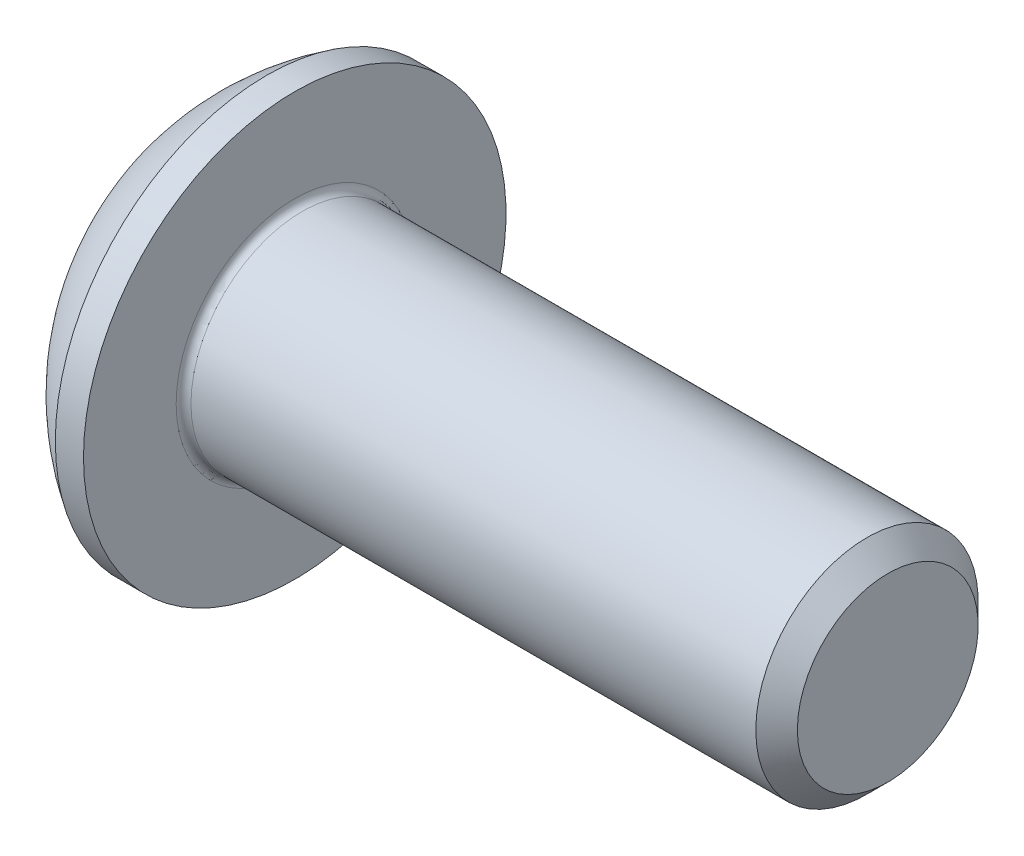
ISO-10303-21;
HEADER;
FILE_DESCRIPTION(('STEP AP214'),'2;1');
FILE_NAME('part.step','',(''),(''),'','','');
FILE_SCHEMA(('AUTOMOTIVE_DESIGN { 1 0 10303 214 1 1 1 1 }'));
ENDSEC;
DATA;
#1=APPLICATION_CONTEXT('core data for automotive mechanical design processes');
#2=APPLICATION_PROTOCOL_DEFINITION('international standard','automotive_design',2000,#1);
#3=PRODUCT_CONTEXT('',#1,'mechanical');
#4=PRODUCT('Part','Part','',(#3));
#5=PRODUCT_RELATED_PRODUCT_CATEGORY('part','',(#4));
#6=PRODUCT_DEFINITION_FORMATION('','',#4);
#7=PRODUCT_DEFINITION_CONTEXT('part definition',#1,'design');
#8=PRODUCT_DEFINITION('design','',#6,#7);
#9=PRODUCT_DEFINITION_SHAPE('','',#8);
#10=(LENGTH_UNIT() NAMED_UNIT(*) SI_UNIT(.MILLI.,.METRE.));
#11=(NAMED_UNIT(*) PLANE_ANGLE_UNIT() SI_UNIT($,.RADIAN.));
#12=(NAMED_UNIT(*) SI_UNIT($,.STERADIAN.) SOLID_ANGLE_UNIT());
#13=UNCERTAINTY_MEASURE_WITH_UNIT(LENGTH_MEASURE(1.E-05),#10,'distance_accuracy_value','');
#14=(GEOMETRIC_REPRESENTATION_CONTEXT(3) GLOBAL_UNCERTAINTY_ASSIGNED_CONTEXT((#13)) GLOBAL_UNIT_ASSIGNED_CONTEXT((#10,
#11,#12)) REPRESENTATION_CONTEXT('',''));
#15=CARTESIAN_POINT('',(0.,0.,0.));
#16=DIRECTION('',(0.,0.,1.));
#17=DIRECTION('',(1.,0.,0.));
#18=AXIS2_PLACEMENT_3D('',#15,#16,#17);
#19=CARTESIAN_POINT('',(0.,0.,0.));
#20=DIRECTION('',(-1.,0.,0.));
#21=DIRECTION('',(0.,0.,1.));
#22=AXIS2_PLACEMENT_3D('',#19,#20,#21);
#23=PLANE('',#22);
#24=CARTESIAN_POINT('',(0.,0.,0.));
#25=DIRECTION('',(-1.,0.,0.));
#26=DIRECTION('',(0.,0.,1.));
#27=AXIS2_PLACEMENT_3D('',#24,#25,#26);
#28=CIRCLE('',#27,1.425);
#29=CARTESIAN_POINT('',(0.,1.425,0.));
#30=VERTEX_POINT('',#29);
#31=EDGE_CURVE('E159',#30,#30,#28,.T.);
#32=ORIENTED_EDGE('',*,*,#31,.T.);
#33=EDGE_LOOP('',(#32));
#34=FACE_BOUND('',#33,.T.);
#35=DIRECTION('',(0.,-1.,0.));
#36=VECTOR('',#35,1.);
#37=CARTESIAN_POINT('',(0.,-0.577350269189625,0.999999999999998));
#38=LINE('',#37,#36);
#39=CARTESIAN_POINT('',(0.,0.577350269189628,1.));
#40=VERTEX_POINT('',#39);
#41=CARTESIAN_POINT('',(0.,-0.577350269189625,0.999999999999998));
#42=VERTEX_POINT('',#41);
#43=EDGE_CURVE('E54',#40,#42,#38,.T.);
#44=ORIENTED_EDGE('',*,*,#43,.T.);
#45=DIRECTION('',(0.,-0.499999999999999,-0.866025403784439));
#46=VECTOR('',#45,1.);
#47=CARTESIAN_POINT('',(0.,-1.15470053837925,0.));
#48=LINE('',#47,#46);
#49=CARTESIAN_POINT('',(0.,-1.15470053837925,0.));
#50=VERTEX_POINT('',#49);
#51=EDGE_CURVE('E279',#42,#50,#48,.T.);
#52=ORIENTED_EDGE('',*,*,#51,.T.);
#53=DIRECTION('',(0.,0.499999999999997,-0.86602540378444));
#54=VECTOR('',#53,1.);
#55=CARTESIAN_POINT('',(0.,-0.577350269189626,-1.));
#56=LINE('',#55,#54);
#57=CARTESIAN_POINT('',(0.,-0.577350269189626,-1.));
#58=VERTEX_POINT('',#57);
#59=EDGE_CURVE('E134',#50,#58,#56,.T.);
#60=ORIENTED_EDGE('',*,*,#59,.T.);
#61=DIRECTION('',(0.,1.,0.));
#62=VECTOR('',#61,1.);
#63=CARTESIAN_POINT('',(0.,0.577350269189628,-1.));
#64=LINE('',#63,#62);
#65=CARTESIAN_POINT('',(0.,0.577350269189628,-1.));
#66=VERTEX_POINT('',#65);
#67=EDGE_CURVE('E282',#58,#66,#64,.T.);
#68=ORIENTED_EDGE('',*,*,#67,.T.);
#69=DIRECTION('',(0.,0.499999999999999,0.866025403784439));
#70=VECTOR('',#69,1.);
#71=CARTESIAN_POINT('',(0.,1.15470053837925,0.));
#72=LINE('',#71,#70);
#73=CARTESIAN_POINT('',(0.,1.15470053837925,0.));
#74=VERTEX_POINT('',#73);
#75=EDGE_CURVE('E284',#66,#74,#72,.T.);
#76=ORIENTED_EDGE('',*,*,#75,.T.);
#77=DIRECTION('',(0.,-0.499999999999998,0.866025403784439));
#78=VECTOR('',#77,1.);
#79=CARTESIAN_POINT('',(0.,0.577350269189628,1.));
#80=LINE('',#79,#78);
#81=EDGE_CURVE('E286',#74,#40,#80,.T.);
#82=ORIENTED_EDGE('',*,*,#81,.T.);
#83=EDGE_LOOP('',(#44,#52,#60,#68,#76,#82));
#84=FACE_BOUND('',#83,.T.);
#85=ADVANCED_FACE('F39',(#34,#84),#23,.T.);
#86=CARTESIAN_POINT('',(3.03337598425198,0.,0.));
#87=DIRECTION('',(-1.,0.,0.));
#88=DIRECTION('',(0.,1.,0.));
#89=AXIS2_PLACEMENT_3D('',#86,#87,#88);
#90=SPHERICAL_SURFACE('',#89,3.35141684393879);
#91=CARTESIAN_POINT('',(1.27,0.,0.));
#92=DIRECTION('',(-1.,0.,0.));
#93=DIRECTION('',(0.,0.,1.));
#94=AXIS2_PLACEMENT_3D('',#91,#92,#93);
#95=CIRCLE('',#94,2.85);
#96=CARTESIAN_POINT('',(1.27,2.85,0.));
#97=VERTEX_POINT('',#96);
#98=EDGE_CURVE('E156',#97,#97,#95,.T.);
#99=CARTESIAN_POINT('',(1.27,2.85,0.));
#100=CARTESIAN_POINT('',(1.2528541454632,2.83939139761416,0.));
#101=CARTESIAN_POINT('',(1.23580404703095,2.82862803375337,0.));
#102=CARTESIAN_POINT('',(1.20190086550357,2.80679536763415,0.));
#103=CARTESIAN_POINT('',(1.18504778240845,2.79572606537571,0.));
#104=CARTESIAN_POINT('',(1.15154413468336,2.77328510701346,0.));
#105=CARTESIAN_POINT('',(1.13489357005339,2.76191345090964,0.));
#106=CARTESIAN_POINT('',(1.10180037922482,2.73887149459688,0.));
#107=CARTESIAN_POINT('',(1.08535775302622,2.72720119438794,0.));
#108=CARTESIAN_POINT('',(1.05268579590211,2.70356574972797,0.));
#109=CARTESIAN_POINT('',(1.03645646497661,2.69160060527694,0.));
#110=CARTESIAN_POINT('',(1.00421638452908,2.66737936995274,0.));
#111=CARTESIAN_POINT('',(0.988205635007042,2.65512327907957,0.));
#112=CARTESIAN_POINT('',(0.956407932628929,2.63032414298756,0.));
#113=CARTESIAN_POINT('',(0.940620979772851,2.61778109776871,0.));
#114=CARTESIAN_POINT('',(0.909276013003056,2.59241213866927,0.));
#115=CARTESIAN_POINT('',(0.89371799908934,2.57958622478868,0.));
#116=CARTESIAN_POINT('',(0.862835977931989,2.55365570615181,0.));
#117=CARTESIAN_POINT('',(0.847511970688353,2.54055110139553,0.));
#118=CARTESIAN_POINT('',(0.817102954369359,2.5140674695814,0.));
#119=CARTESIAN_POINT('',(0.802017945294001,2.50068844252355,0.));
#120=CARTESIAN_POINT('',(0.772091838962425,2.47366032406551,0.));
#121=CARTESIAN_POINT('',(0.757250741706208,2.46001123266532,0.));
#122=CARTESIAN_POINT('',(0.727817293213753,2.43244743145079,0.));
#123=CARTESIAN_POINT('',(0.713224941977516,2.41853272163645,0.));
#124=CARTESIAN_POINT('',(0.68429373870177,2.39044221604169,0.));
#125=CARTESIAN_POINT('',(0.669954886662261,2.37626642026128,0.));
#126=CARTESIAN_POINT('',(0.641535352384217,2.3476583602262,0.));
#127=CARTESIAN_POINT('',(0.627454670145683,2.33322609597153,0.));
#128=CARTESIAN_POINT('',(0.599556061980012,2.30410980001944,0.));
#129=CARTESIAN_POINT('',(0.585738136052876,2.289425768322,0.));
#130=CARTESIAN_POINT('',(0.55836954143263,2.25981072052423,0.));
#131=CARTESIAN_POINT('',(0.54481887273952,2.24487970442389,0.));
#132=CARTESIAN_POINT('',(0.517989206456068,2.21477555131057,0.));
#133=CARTESIAN_POINT('',(0.504710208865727,2.19960241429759,0.));
#134=CARTESIAN_POINT('',(0.478428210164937,2.16901896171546,0.));
#135=CARTESIAN_POINT('',(0.465425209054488,2.15360864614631,0.));
#136=CARTESIAN_POINT('',(0.439699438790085,2.12255585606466,0.));
#137=CARTESIAN_POINT('',(0.426976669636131,2.10691338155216,0.));
#138=CARTESIAN_POINT('',(0.401815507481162,2.07540136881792,0.));
#139=CARTESIAN_POINT('',(0.389377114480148,2.05953183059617,0.));
#140=CARTESIAN_POINT('',(0.364788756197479,2.02757085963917,0.));
#141=CARTESIAN_POINT('',(0.352638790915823,2.0114794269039,0.));
#142=CARTESIAN_POINT('',(0.328631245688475,1.97907990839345,0.));
#143=CARTESIAN_POINT('',(0.316773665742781,1.96277182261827,0.));
#144=CARTESIAN_POINT('',(0.293354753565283,1.92994431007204,0.));
#145=CARTESIAN_POINT('',(0.281793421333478,1.91342488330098,0.));
#146=CARTESIAN_POINT('',(0.258970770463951,1.88018006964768,0.));
#147=CARTESIAN_POINT('',(0.24770945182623,1.86345468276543,0.));
#148=CARTESIAN_POINT('',(0.225490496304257,1.82980339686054,0.));
#149=CARTESIAN_POINT('',(0.214532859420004,1.8128774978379,0.));
#150=CARTESIAN_POINT('',(0.192924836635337,1.77883070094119,0.));
#151=CARTESIAN_POINT('',(0.182274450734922,1.76170980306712,0.));
#152=CARTESIAN_POINT('',(0.161284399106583,1.72727858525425,0.));
#153=CARTESIAN_POINT('',(0.150944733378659,1.70996826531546,0.));
#154=CARTESIAN_POINT('',(0.13057948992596,1.6751638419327,0.));
#155=CARTESIAN_POINT('',(0.120553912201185,1.65766973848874,0.));
#156=CARTESIAN_POINT('',(0.100820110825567,1.62250344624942,0.));
#157=CARTESIAN_POINT('',(0.0911118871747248,1.60483125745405,0.));
#158=CARTESIAN_POINT('',(0.0720159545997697,1.56931455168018,0.));
#159=CARTESIAN_POINT('',(0.062628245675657,1.55147003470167,0.));
#160=CARTESIAN_POINT('',(0.0441764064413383,1.51561448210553,0.));
#161=CARTESIAN_POINT('',(0.0351122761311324,1.49760344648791,0.));
#162=CARTESIAN_POINT('',(0.017310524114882,1.46142073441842,0.));
#163=CARTESIAN_POINT('',(0.00857290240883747,1.44324905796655,0.));
#164=CARTESIAN_POINT('',(0.,1.425,0.));
#165=B_SPLINE_CURVE_WITH_KNOTS('',3,(#99,#100,#101,#102,#103,#104,#105,#106,#107,#108,#109,#110,
#111,#112,#113,#114,#115,#116,#117,#118,#119,#120,#121,#122,#123,#124,#125,#126,#127,#128,#129,
#130,#131,#132,#133,#134,#135,#136,#137,#138,#139,#140,#141,#142,#143,#144,#145,#146,#147,#148,
#149,#150,#151,#152,#153,#154,#155,#156,#157,#158,#159,#160,#161,#162,#163,#164),.UNSPECIFIED.,
.F.,.F.,(4,2,2,2,2,2,2,2,2,2,2,2,2,2,2,2,2,2,2,2,2,2,2,2,2,2,2,2,2,2,2,2,4),(0.,
0.0604864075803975,0.120972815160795,0.181459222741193,0.24194563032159,0.302432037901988,
0.362918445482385,0.423404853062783,0.483891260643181,0.544377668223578,0.604864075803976,
0.665350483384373,0.725836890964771,0.786323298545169,0.846809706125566,0.907296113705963,
0.967782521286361,1.02826892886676,1.08875533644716,1.14924174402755,1.20972815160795,
1.27021455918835,1.33070096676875,1.39118737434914,1.45167378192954,1.51216018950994,
1.57264659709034,1.63313300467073,1.69361941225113,1.75410581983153,1.81459222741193,
1.87507863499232,1.93556504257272),.UNSPECIFIED.);
#166=EDGE_CURVE('BSEAM180',#97,#30,#165,.T.);
#167=ORIENTED_EDGE('',*,*,#98,.T.);
#168=ORIENTED_EDGE('',*,*,#31,.F.);
#169=ORIENTED_EDGE('',*,*,#166,.T.);
#170=ORIENTED_EDGE('',*,*,#166,.F.);
#171=EDGE_LOOP('',(#167,#169,#168,#170));
#172=FACE_BOUND('',#171,.T.);
#173=ADVANCED_FACE('F180',(#172),#90,.T.);
#174=CARTESIAN_POINT('',(0.,0.,0.));
#175=DIRECTION('',(-1.,0.,0.));
#176=DIRECTION('',(0.,0.,1.));
#177=AXIS2_PLACEMENT_3D('',#174,#175,#176);
#178=CYLINDRICAL_SURFACE('',#177,2.85);
#179=ORIENTED_EDGE('',*,*,#98,.F.);
#180=EDGE_LOOP('',(#179));
#181=FACE_BOUND('',#180,.T.);
#182=CARTESIAN_POINT('',(1.65,0.,0.));
#183=DIRECTION('',(-1.,0.,0.));
#184=DIRECTION('',(0.,0.,1.));
#185=AXIS2_PLACEMENT_3D('',#182,#183,#184);
#186=CIRCLE('',#185,2.85);
#187=CARTESIAN_POINT('',(1.65,0.,2.85));
#188=VERTEX_POINT('',#187);
#189=EDGE_CURVE('E153',#188,#188,#186,.T.);
#190=ORIENTED_EDGE('',*,*,#189,.T.);
#191=EDGE_LOOP('',(#190));
#192=FACE_BOUND('',#191,.T.);
#193=ADVANCED_FACE('F185',(#181,#192),#178,.T.);
#194=CARTESIAN_POINT('',(1.65,1.49999999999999,0.));
#195=DIRECTION('',(-1.,0.,0.));
#196=DIRECTION('',(0.,0.,1.));
#197=AXIS2_PLACEMENT_3D('',#194,#195,#196);
#198=PLANE('',#197);
#199=CARTESIAN_POINT('',(1.65,0.,0.));
#200=DIRECTION('',(-1.,0.,0.));
#201=DIRECTION('',(0.,0.,1.));
#202=AXIS2_PLACEMENT_3D('',#199,#200,#201);
#203=CIRCLE('',#202,1.6);
#204=CARTESIAN_POINT('',(1.65,0.,1.6));
#205=VERTEX_POINT('',#204);
#206=EDGE_CURVE('E47',#205,#205,#203,.T.);
#207=ORIENTED_EDGE('',*,*,#206,.T.);
#208=EDGE_LOOP('',(#207));
#209=FACE_BOUND('',#208,.T.);
#210=ORIENTED_EDGE('',*,*,#189,.F.);
#211=EDGE_LOOP('',(#210));
#212=FACE_BOUND('',#211,.T.);
#213=ADVANCED_FACE('F164',(#209,#212),#198,.F.);
#214=CARTESIAN_POINT('',(0.,0.,0.));
#215=DIRECTION('',(-1.,0.,0.));
#216=DIRECTION('',(0.,0.,1.));
#217=AXIS2_PLACEMENT_3D('',#214,#215,#216);
#218=CYLINDRICAL_SURFACE('',#217,1.5);
#219=CARTESIAN_POINT('',(1.75,0.,0.));
#220=DIRECTION('',(-1.,0.,0.));
#221=DIRECTION('',(0.,0.,1.));
#222=AXIS2_PLACEMENT_3D('',#219,#220,#221);
#223=CIRCLE('',#222,1.5);
#224=CARTESIAN_POINT('',(1.75,0.,1.5));
#225=VERTEX_POINT('',#224);
#226=EDGE_CURVE('E11',#225,#225,#223,.F.);
#227=ORIENTED_EDGE('',*,*,#226,.T.);
#228=EDGE_LOOP('',(#227));
#229=FACE_BOUND('',#228,.T.);
#230=CARTESIAN_POINT('',(9.3695,0.,0.));
#231=DIRECTION('',(-1.,0.,0.));
#232=DIRECTION('',(0.,0.,1.));
#233=AXIS2_PLACEMENT_3D('',#230,#231,#232);
#234=CIRCLE('',#233,1.5);
#235=CARTESIAN_POINT('',(9.3695,0.,1.5));
#236=VERTEX_POINT('',#235);
#237=EDGE_CURVE('E150',#236,#236,#234,.T.);
#238=ORIENTED_EDGE('',*,*,#237,.T.);
#239=EDGE_LOOP('',(#238));
#240=FACE_BOUND('',#239,.T.);
#241=ADVANCED_FACE('F194',(#229,#240),#218,.T.);
#242=CARTESIAN_POINT('',(9.65,0.,0.));
#243=DIRECTION('',(-1.,0.,0.));
#244=DIRECTION('',(0.,0.,1.));
#245=AXIS2_PLACEMENT_3D('',#242,#243,#244);
#246=CONICAL_SURFACE('',#245,1.2195,0.785398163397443);
#247=ORIENTED_EDGE('',*,*,#237,.F.);
#248=EDGE_LOOP('',(#247));
#249=FACE_BOUND('',#248,.T.);
#250=CARTESIAN_POINT('',(9.65,0.,0.));
#251=DIRECTION('',(-1.,0.,0.));
#252=DIRECTION('',(0.,0.,1.));
#253=AXIS2_PLACEMENT_3D('',#250,#251,#252);
#254=CIRCLE('',#253,1.2195);
#255=CARTESIAN_POINT('',(9.65,0.,1.2195));
#256=VERTEX_POINT('',#255);
#257=EDGE_CURVE('E146',#256,#256,#254,.T.);
#258=ORIENTED_EDGE('',*,*,#257,.T.);
#259=EDGE_LOOP('',(#258));
#260=FACE_BOUND('',#259,.T.);
#261=ADVANCED_FACE('F175',(#249,#260),#246,.T.);
#262=CARTESIAN_POINT('',(9.65,0.,0.));
#263=DIRECTION('',(-1.,0.,0.));
#264=DIRECTION('',(0.,0.,1.));
#265=AXIS2_PLACEMENT_3D('',#262,#263,#264);
#266=PLANE('',#265);
#267=ORIENTED_EDGE('',*,*,#257,.F.);
#268=EDGE_LOOP('',(#267));
#269=FACE_BOUND('',#268,.T.);
#270=ADVANCED_FACE('F168',(#269),#266,.F.);
#271=CARTESIAN_POINT('',(1.75,0.,0.));
#272=DIRECTION('',(-1.,0.,0.));
#273=DIRECTION('',(0.,0.,1.));
#274=AXIS2_PLACEMENT_3D('',#271,#272,#273);
#275=TOROIDAL_SURFACE('',#274,1.6,0.1);
#276=ORIENTED_EDGE('',*,*,#226,.F.);
#277=EDGE_LOOP('',(#276));
#278=FACE_BOUND('',#277,.T.);
#279=ORIENTED_EDGE('',*,*,#206,.F.);
#280=EDGE_LOOP('',(#279));
#281=FACE_BOUND('',#280,.T.);
#282=ADVANCED_FACE('F41',(#278,#281),#275,.F.);
#283=CARTESIAN_POINT('',(1.04,-1.15470053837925,0.));
#284=DIRECTION('',(0.,0.866025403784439,-0.499999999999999));
#285=DIRECTION('',(0.,0.499999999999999,0.866025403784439));
#286=AXIS2_PLACEMENT_3D('',#283,#284,#285);
#287=PLANE('',#286);
#288=DIRECTION('',(0.,-0.499999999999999,-0.866025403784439));
#289=VECTOR('',#288,1.);
#290=CARTESIAN_POINT('',(1.04,-1.15470053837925,0.));
#291=LINE('',#290,#289);
#292=CARTESIAN_POINT('',(1.04,-0.577350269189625,0.999999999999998));
#293=VERTEX_POINT('',#292);
#294=CARTESIAN_POINT('',(1.04,-0.866025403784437,0.499999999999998));
#295=VERTEX_POINT('',#294);
#296=EDGE_CURVE('E120',#293,#295,#291,.T.);
#297=ORIENTED_EDGE('',*,*,#296,.T.);
#298=CARTESIAN_POINT('',(1.04,-1.15470053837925,0.));
#299=VERTEX_POINT('',#298);
#300=EDGE_CURVE('E115',#295,#299,#291,.T.);
#301=ORIENTED_EDGE('',*,*,#300,.T.);
#302=DIRECTION('',(-1.,0.,0.));
#303=VECTOR('',#302,1.);
#304=CARTESIAN_POINT('',(1.04,-1.15470053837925,0.));
#305=LINE('',#304,#303);
#306=EDGE_CURVE('E117',#299,#50,#305,.T.);
#307=ORIENTED_EDGE('',*,*,#306,.T.);
#308=ORIENTED_EDGE('',*,*,#51,.F.);
#309=DIRECTION('',(-1.,0.,0.));
#310=VECTOR('',#309,1.);
#311=CARTESIAN_POINT('',(1.04,-0.577350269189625,0.999999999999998));
#312=LINE('',#311,#310);
#313=EDGE_CURVE('E275',#293,#42,#312,.T.);
#314=ORIENTED_EDGE('',*,*,#313,.F.);
#315=EDGE_LOOP('',(#297,#301,#307,#308,#314));
#316=FACE_BOUND('',#315,.T.);
#317=ADVANCED_FACE('F116',(#316),#287,.T.);
#318=CARTESIAN_POINT('',(1.04,-0.577350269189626,-1.));
#319=DIRECTION('',(0.,0.86602540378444,0.499999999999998));
#320=DIRECTION('',(0.,-0.499999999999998,0.86602540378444));
#321=AXIS2_PLACEMENT_3D('',#318,#319,#320);
#322=PLANE('',#321);
#323=DIRECTION('',(0.,0.499999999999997,-0.86602540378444));
#324=VECTOR('',#323,1.);
#325=CARTESIAN_POINT('',(1.04,-0.577350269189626,-1.));
#326=LINE('',#325,#324);
#327=CARTESIAN_POINT('',(1.04,-0.86602540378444,-0.499999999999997));
#328=VERTEX_POINT('',#327);
#329=EDGE_CURVE('E62',#299,#328,#326,.T.);
#330=ORIENTED_EDGE('',*,*,#329,.T.);
#331=CARTESIAN_POINT('',(1.04,-0.577350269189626,-1.));
#332=VERTEX_POINT('',#331);
#333=EDGE_CURVE('E129',#328,#332,#326,.T.);
#334=ORIENTED_EDGE('',*,*,#333,.T.);
#335=DIRECTION('',(-1.,0.,0.));
#336=VECTOR('',#335,1.);
#337=CARTESIAN_POINT('',(1.04,-0.577350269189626,-1.));
#338=LINE('',#337,#336);
#339=EDGE_CURVE('E136',#332,#58,#338,.T.);
#340=ORIENTED_EDGE('',*,*,#339,.T.);
#341=ORIENTED_EDGE('',*,*,#59,.F.);
#342=ORIENTED_EDGE('',*,*,#306,.F.);
#343=EDGE_LOOP('',(#330,#334,#340,#341,#342));
#344=FACE_BOUND('',#343,.T.);
#345=ADVANCED_FACE('F132',(#344),#322,.T.);
#346=CARTESIAN_POINT('',(1.04,0.577350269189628,-1.));
#347=DIRECTION('',(0.,0.,1.));
#348=DIRECTION('',(1.,0.,0.));
#349=AXIS2_PLACEMENT_3D('',#346,#347,#348);
#350=PLANE('',#349);
#351=DIRECTION('',(0.,1.,0.));
#352=VECTOR('',#351,1.);
#353=CARTESIAN_POINT('',(1.04,0.577350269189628,-1.));
#354=LINE('',#353,#352);
#355=CARTESIAN_POINT('',(1.04,0.,-1.));
#356=VERTEX_POINT('',#355);
#357=EDGE_CURVE('E256',#332,#356,#354,.T.);
#358=ORIENTED_EDGE('',*,*,#357,.T.);
#359=CARTESIAN_POINT('',(1.04,0.577350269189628,-1.));
#360=VERTEX_POINT('',#359);
#361=EDGE_CURVE('E128',#356,#360,#354,.T.);
#362=ORIENTED_EDGE('',*,*,#361,.T.);
#363=DIRECTION('',(-1.,0.,0.));
#364=VECTOR('',#363,1.);
#365=CARTESIAN_POINT('',(1.04,0.577350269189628,-1.));
#366=LINE('',#365,#364);
#367=EDGE_CURVE('E141',#360,#66,#366,.T.);
#368=ORIENTED_EDGE('',*,*,#367,.T.);
#369=ORIENTED_EDGE('',*,*,#67,.F.);
#370=ORIENTED_EDGE('',*,*,#339,.F.);
#371=EDGE_LOOP('',(#358,#362,#368,#369,#370));
#372=FACE_BOUND('',#371,.T.);
#373=ADVANCED_FACE('F208',(#372),#350,.T.);
#374=CARTESIAN_POINT('',(1.04,1.15470053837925,0.));
#375=DIRECTION('',(0.,-0.86602540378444,0.499999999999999));
#376=DIRECTION('',(0.,-0.499999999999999,-0.866025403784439));
#377=AXIS2_PLACEMENT_3D('',#374,#375,#376);
#378=PLANE('',#377);
#379=DIRECTION('',(0.,0.499999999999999,0.866025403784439));
#380=VECTOR('',#379,1.);
#381=CARTESIAN_POINT('',(1.04,1.15470053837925,0.));
#382=LINE('',#381,#380);
#383=CARTESIAN_POINT('',(1.04,0.86602540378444,-0.499999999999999));
#384=VERTEX_POINT('',#383);
#385=EDGE_CURVE('E245',#360,#384,#382,.T.);
#386=ORIENTED_EDGE('',*,*,#385,.T.);
#387=CARTESIAN_POINT('',(1.04,1.15470053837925,0.));
#388=VERTEX_POINT('',#387);
#389=EDGE_CURVE('E250',#384,#388,#382,.T.);
#390=ORIENTED_EDGE('',*,*,#389,.T.);
#391=DIRECTION('',(-1.,0.,0.));
#392=VECTOR('',#391,1.);
#393=CARTESIAN_POINT('',(1.04,1.15470053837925,0.));
#394=LINE('',#393,#392);
#395=EDGE_CURVE('E290',#388,#74,#394,.T.);
#396=ORIENTED_EDGE('',*,*,#395,.T.);
#397=ORIENTED_EDGE('',*,*,#75,.F.);
#398=ORIENTED_EDGE('',*,*,#367,.F.);
#399=EDGE_LOOP('',(#386,#390,#396,#397,#398));
#400=FACE_BOUND('',#399,.T.);
#401=ADVANCED_FACE('F211',(#400),#378,.T.);
#402=CARTESIAN_POINT('',(1.04,0.577350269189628,1.));
#403=DIRECTION('',(0.,-0.86602540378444,-0.499999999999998));
#404=DIRECTION('',(0.,0.499999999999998,-0.86602540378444));
#405=AXIS2_PLACEMENT_3D('',#402,#403,#404);
#406=PLANE('',#405);
#407=DIRECTION('',(0.,-0.499999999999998,0.866025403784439));
#408=VECTOR('',#407,1.);
#409=CARTESIAN_POINT('',(1.04,0.577350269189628,1.));
#410=LINE('',#409,#408);
#411=CARTESIAN_POINT('',(1.04,0.86602540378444,0.499999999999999));
#412=VERTEX_POINT('',#411);
#413=EDGE_CURVE('E253',#388,#412,#410,.T.);
#414=ORIENTED_EDGE('',*,*,#413,.T.);
#415=CARTESIAN_POINT('',(1.04,0.577350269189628,1.));
#416=VERTEX_POINT('',#415);
#417=EDGE_CURVE('E261',#412,#416,#410,.T.);
#418=ORIENTED_EDGE('',*,*,#417,.T.);
#419=DIRECTION('',(-1.,0.,0.));
#420=VECTOR('',#419,1.);
#421=CARTESIAN_POINT('',(1.04,0.577350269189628,1.));
#422=LINE('',#421,#420);
#423=EDGE_CURVE('E274',#416,#40,#422,.T.);
#424=ORIENTED_EDGE('',*,*,#423,.T.);
#425=ORIENTED_EDGE('',*,*,#81,.F.);
#426=ORIENTED_EDGE('',*,*,#395,.F.);
#427=EDGE_LOOP('',(#414,#418,#424,#425,#426));
#428=FACE_BOUND('',#427,.T.);
#429=ADVANCED_FACE('F215',(#428),#406,.T.);
#430=CARTESIAN_POINT('',(1.04,-0.577350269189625,0.999999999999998));
#431=DIRECTION('',(0.,0.,-1.));
#432=DIRECTION('',(0.,1.,0.));
#433=AXIS2_PLACEMENT_3D('',#430,#431,#432);
#434=PLANE('',#433);
#435=DIRECTION('',(0.,-1.,0.));
#436=VECTOR('',#435,1.);
#437=CARTESIAN_POINT('',(1.04,-0.577350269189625,0.999999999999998));
#438=LINE('',#437,#436);
#439=CARTESIAN_POINT('',(1.04,0.,1.));
#440=VERTEX_POINT('',#439);
#441=EDGE_CURVE('E267',#416,#440,#438,.T.);
#442=ORIENTED_EDGE('',*,*,#441,.T.);
#443=EDGE_CURVE('E269',#440,#293,#438,.T.);
#444=ORIENTED_EDGE('',*,*,#443,.T.);
#445=ORIENTED_EDGE('',*,*,#313,.T.);
#446=ORIENTED_EDGE('',*,*,#43,.F.);
#447=ORIENTED_EDGE('',*,*,#423,.F.);
#448=EDGE_LOOP('',(#442,#444,#445,#446,#447));
#449=FACE_BOUND('',#448,.T.);
#450=ADVANCED_FACE('F219',(#449),#434,.T.);
#451=CARTESIAN_POINT('',(1.04,-1.73205080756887,-1.));
#452=DIRECTION('',(1.,0.,0.));
#453=DIRECTION('',(0.,0.,-1.));
#454=AXIS2_PLACEMENT_3D('',#451,#452,#453);
#455=PLANE('',#454);
#456=CARTESIAN_POINT('',(1.04,0.,0.));
#457=DIRECTION('',(-1.,0.,0.));
#458=DIRECTION('',(0.,0.,1.));
#459=AXIS2_PLACEMENT_3D('',#456,#457,#458);
#460=CIRCLE('',#459,1.);
#461=EDGE_CURVE('E242',#384,#356,#460,.T.);
#462=ORIENTED_EDGE('',*,*,#461,.F.);
#463=ORIENTED_EDGE('',*,*,#385,.F.);
#464=ORIENTED_EDGE('',*,*,#361,.F.);
#465=EDGE_LOOP('',(#462,#463,#464));
#466=FACE_BOUND('',#465,.T.);
#467=ADVANCED_FACE('F223',(#466),#455,.F.);
#468=EDGE_CURVE('E147',#412,#384,#460,.T.);
#469=ORIENTED_EDGE('',*,*,#468,.F.);
#470=ORIENTED_EDGE('',*,*,#413,.F.);
#471=ORIENTED_EDGE('',*,*,#389,.F.);
#472=EDGE_LOOP('',(#469,#470,#471));
#473=FACE_BOUND('',#472,.T.);
#474=ADVANCED_FACE('F232',(#473),#455,.F.);
#475=EDGE_CURVE('E140',#440,#412,#460,.T.);
#476=ORIENTED_EDGE('',*,*,#475,.F.);
#477=ORIENTED_EDGE('',*,*,#441,.F.);
#478=ORIENTED_EDGE('',*,*,#417,.F.);
#479=EDGE_LOOP('',(#476,#477,#478));
#480=FACE_BOUND('',#479,.T.);
#481=ADVANCED_FACE('F237',(#480),#455,.F.);
#482=EDGE_CURVE('E135',#295,#440,#460,.T.);
#483=ORIENTED_EDGE('',*,*,#482,.F.);
#484=ORIENTED_EDGE('',*,*,#296,.F.);
#485=ORIENTED_EDGE('',*,*,#443,.F.);
#486=EDGE_LOOP('',(#483,#484,#485));
#487=FACE_BOUND('',#486,.T.);
#488=ADVANCED_FACE('F230',(#487),#455,.F.);
#489=EDGE_CURVE('E126',#328,#295,#460,.T.);
#490=ORIENTED_EDGE('',*,*,#489,.F.);
#491=ORIENTED_EDGE('',*,*,#329,.F.);
#492=ORIENTED_EDGE('',*,*,#300,.F.);
#493=EDGE_LOOP('',(#490,#491,#492));
#494=FACE_BOUND('',#493,.T.);
#495=ADVANCED_FACE('F125',(#494),#455,.F.);
#496=EDGE_CURVE('E248',#356,#328,#460,.T.);
#497=ORIENTED_EDGE('',*,*,#496,.F.);
#498=ORIENTED_EDGE('',*,*,#357,.F.);
#499=ORIENTED_EDGE('',*,*,#333,.F.);
#500=EDGE_LOOP('',(#497,#498,#499));
#501=FACE_BOUND('',#500,.T.);
#502=ADVANCED_FACE('F203',(#501),#455,.F.);
#503=CARTESIAN_POINT('',(1.61735026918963,0.,0.));
#504=DIRECTION('',(-1.,0.,0.));
#505=DIRECTION('',(0.,0.,1.));
#506=AXIS2_PLACEMENT_3D('',#503,#504,#505);
#507=CONICAL_SURFACE('',#506,0.,1.04719755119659);
#508=ORIENTED_EDGE('',*,*,#475,.T.);
#509=ORIENTED_EDGE('',*,*,#468,.T.);
#510=ORIENTED_EDGE('',*,*,#461,.T.);
#511=ORIENTED_EDGE('',*,*,#496,.T.);
#512=ORIENTED_EDGE('',*,*,#489,.T.);
#513=ORIENTED_EDGE('',*,*,#482,.T.);
#514=EDGE_LOOP('',(#508,#509,#510,#511,#512,#513));
#515=FACE_BOUND('',#514,.T.);
#516=CARTESIAN_POINT('',(1.61735026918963,0.,0.));
#517=VERTEX_POINT('',#516);
#518=VERTEX_LOOP('',#517);
#519=FACE_BOUND('',#518,.T.);
#520=ADVANCED_FACE('F201',(#515,#519),#507,.F.);
#521=CLOSED_SHELL('',(#85,#173,#193,#213,#241,#261,#270,#282,#317,#345,#373,#401,#429,#450,#467,
#474,#481,#488,#495,#502,#520));
#522=MANIFOLD_SOLID_BREP('B2',#521);
#523=ADVANCED_BREP_SHAPE_REPRESENTATION('',(#18,#522),#14);
#524=SHAPE_DEFINITION_REPRESENTATION(#9,#523);
ENDSEC;
END-ISO-10303-21;
